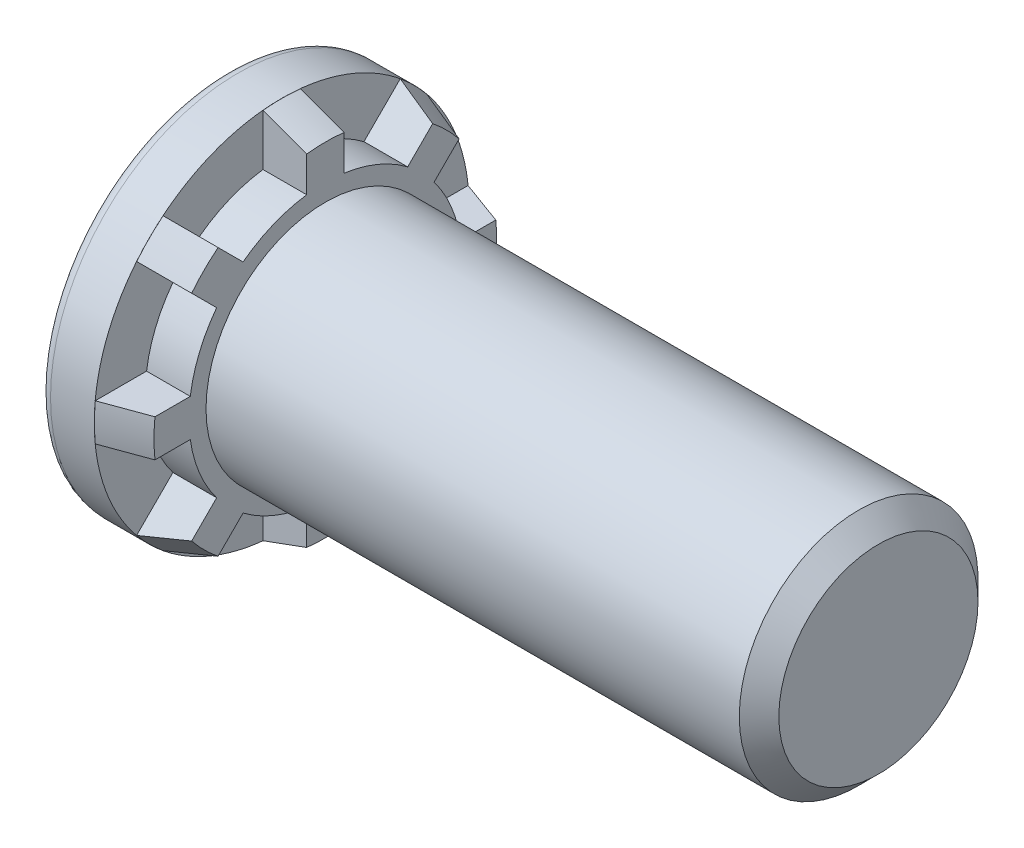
from build123d import *

# Parameters (mm, degrees)
RIBCUT_START     = -1.832
RIBCUT_DEPTH     = 1.832
RIBCUTSPAT_COUNT = 8
RIBCUTSPAT_ANGLE = 315


with BuildPart() as part:
    # BodySke → BaseBody (revolve)
    with BuildSketch(Plane.XY, mode=Mode.PRIVATE) as basebody_sk:
        with BuildLine():
            Line((-2.29, 7.392), (-2.29, 0))
            Line((-2.29, 0), (25, 0))
            Line((25, 0), (25, 4.172))
            Line((25, 4.172), (24.172, 5))
            Line((24.172, 5), (1.832, 5))
            Line((1.832, 5), (1.832, 7.181591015))
            Line((1.832, 7.181591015), (0.00254, 7.84746))
            Line((0.00254, 7.84746), (0, 7.84746))
            Line((0, 7.84746), (0, 7.85))
            Line((0, 7.85), (-1.832, 7.85))
            ThreePointArc((-1.832, 7.85), (-2.155854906, 7.715854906), (-2.29, 7.392))
        make_face()
    revolve(basebody_sk.sketch.rotate(Axis((0, 0, 0), (1, 0, 0)), 90), axis=Axis((0, 0, 0), (1, 0, 0)))

    # RibCutSke → RibCut (cut)
    with BuildSketch(Plane(origin=(1.832, 1.794401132, -0.090952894), x_dir=(0, 0, -1), z_dir=(1, 0, 0)).offset(RIBCUT_START)):
        with BuildLine():
            Line((0.691219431, 3.864296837), (0.691219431, 6.016533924))
            ThreePointArc((0.691219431, 6.016533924), (2.91311205, 5.458053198), (4.879132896, 4.281843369))
            Line((4.879132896, 4.281843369), (3.357271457, 2.759981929))
            ThreePointArc((3.357271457, 2.759981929), (2.095126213, 3.483260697), (0.691219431, 3.864296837))
        make_face()
    ribcut = extrude(amount=RIBCUT_DEPTH, mode=Mode.SUBTRACT)

    # RibCutsPat: RibCut ×8 about axis
    ribcutspat_axis = Axis((0, 0, 0), (1, 0, 0))
    for i in range(1, RIBCUTSPAT_COUNT):
        add(ribcut.rotate(ribcutspat_axis, i * RIBCUTSPAT_ANGLE / (RIBCUTSPAT_COUNT - 1)), mode=Mode.SUBTRACT)


solid = part.part
